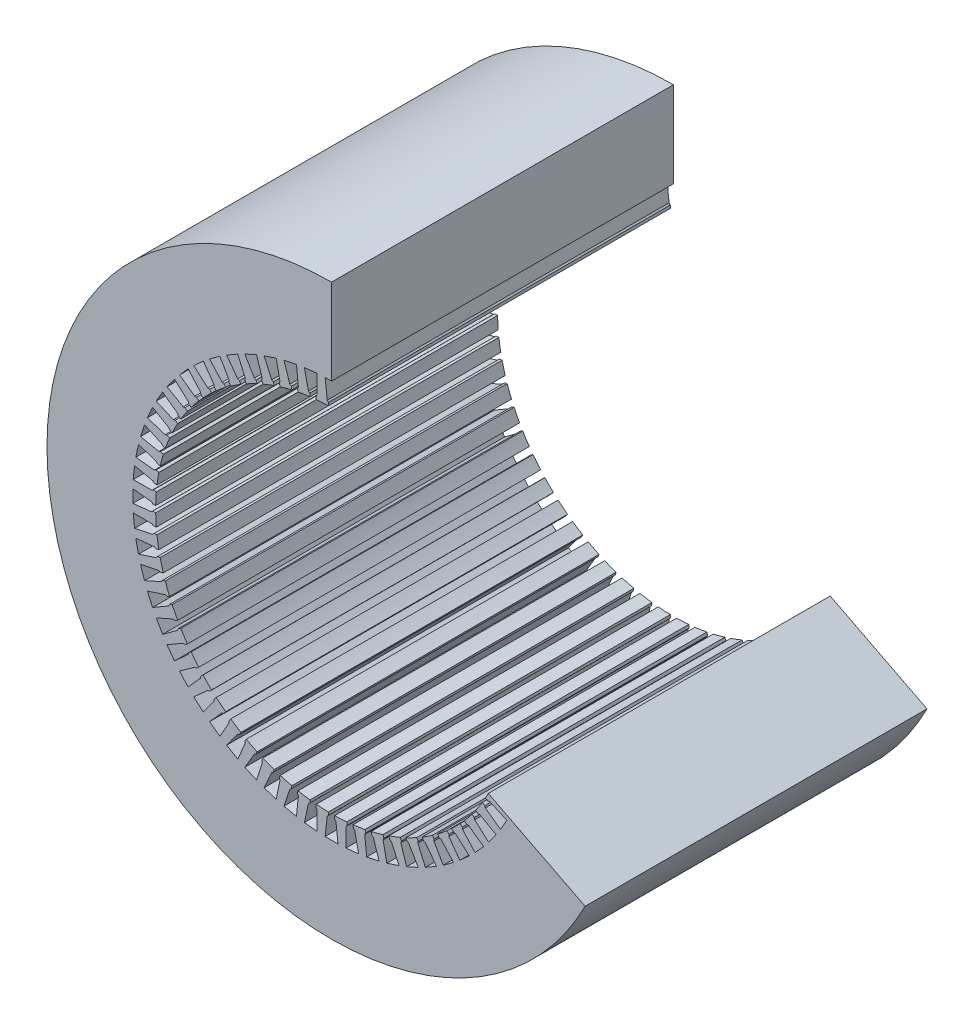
from build123d import *

# Parameters (mm, degrees)
SKICA1_R                 = 127
P_IDAT_VYSUNUT_M1_DEPTH  = 152.6
M_TKO1_SCALE             = 0.655
ODEBRAT_VYSUNUT_M1_DEPTH = 155.369979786


with BuildPart() as part:
    # Skica1 → P_idat vysunut_m1 (new body)
    with BuildSketch(Plane.XY):
        Circle(SKICA1_R)
        with BuildLine():
            Line((1.945, 80.4), (1.4, 79.8))
            Line((1.4, 79.8), (1.4, 78.487514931))
            ThreePointArc((1.4, 78.487514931), (4.108372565, 78.392418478), (6.811848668, 78.20389196))
            Line((6.811848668, 78.20389196), (6.949040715, 79.509187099))
            Line((6.949040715, 79.509187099), (6.46974336, 80.162868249))
            Line((6.46974336, 80.162868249), (6.433359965, 88.522466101))
            Line((6.433359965, 88.522466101), (12.112079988, 87.925608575))
            Line((12.112079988, 87.925608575), (10.338433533, 79.756252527))
            Line((10.338433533, 79.756252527), (9.733702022, 79.216507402))
            Line((9.733702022, 79.216507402), (9.596509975, 77.911212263))
            ThreePointArc((9.596509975, 77.911212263), (12.280105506, 77.533534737), (14.949065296, 77.063450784))
            Line((14.949065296, 77.063450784), (15.221946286, 78.347254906))
            Line((15.221946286, 78.347254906), (14.813602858, 79.047455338))
            Line((14.813602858, 79.047455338), (15.651234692, 87.365061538))
            Line((15.651234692, 87.365061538), (21.236457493, 86.177885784))
            Line((21.236457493, 86.177885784), (18.618597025, 78.23867886))
            Line((18.618597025, 78.23867886), (17.960759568, 77.765102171))
            Line((17.960759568, 77.765102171), (17.687878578, 76.48129805))
            ThreePointArc((17.687878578, 76.48129805), (20.317295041, 75.825177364), (22.922496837, 75.078686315))
            Line((22.922496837, 75.078686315), (23.328077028, 76.326933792))
            Line((23.328077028, 76.326933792), (22.995161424, 77.065981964))
            Line((22.995161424, 77.065981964), (24.697631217, 85.250467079))
            Line((24.697631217, 85.250467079), (30.128163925, 83.485980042))
            Line((30.128163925, 83.485980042), (26.694771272, 75.863905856))
            Line((26.694771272, 75.863905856), (25.991035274, 75.461686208))
            Line((25.991035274, 75.461686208), (25.585455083, 74.213438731))
            ThreePointArc((25.585455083, 74.213438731), (28.131884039, 73.28606348), (30.644784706, 72.271344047))
            Line((30.644784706, 72.271344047), (31.178620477, 73.47035882))
            Line((31.178620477, 73.47035882), (30.924780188, 74.240157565))
            Line((30.924780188, 74.240157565), (33.473435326, 82.201850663))
            Line((33.473435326, 82.201850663), (38.689779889, 79.879384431))
            Line((38.689779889, 79.879384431), (34.478472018, 72.657952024))
            Line((34.478472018, 72.657952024), (33.736547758, 72.33149622))
            Line((33.736547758, 72.33149622), (33.202711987, 71.132481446))
            ThreePointArc((33.202711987, 71.132481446), (35.63825423, 69.944012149), (38.0313219, 68.67218181))
            Line((38.0313219, 68.67218181), (38.687564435, 69.808827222))
            Line((38.687564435, 69.808827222), (38.51558059, 70.600942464))
            Line((38.51558059, 70.600942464), (41.882497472, 78.25261357))
            Line((41.882497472, 78.25261357), (46.827502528, 75.39761357))
            Line((46.827502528, 75.39761357), (41.88441941, 68.655942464))
            Line((41.88441941, 68.655942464), (41.112435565, 68.408827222))
            Line((41.112435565, 68.408827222), (40.456193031, 67.27218181))
            ThreePointArc((40.456193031, 67.27218181), (42.754164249, 65.835639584), (45.001179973, 64.320632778))
            Line((45.001179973, 64.320632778), (45.772639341, 65.382455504))
            Line((45.772639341, 65.382455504), (45.68439623, 66.188208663))
            Line((45.68439623, 66.188208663), (49.832686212, 73.446024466))
            Line((49.832686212, 73.446024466), (54.45217325, 70.089770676))
            Line((54.45217325, 70.089770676), (48.831472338, 63.901724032))
            Line((48.831472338, 63.901724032), (48.037886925, 63.736656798))
            Line((48.037886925, 63.736656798), (47.266427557, 62.674834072))
            ThreePointArc((47.266427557, 62.674834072), (49.401650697, 61.005957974), (51.477995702, 59.264373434))
            Line((51.477995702, 59.264373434), (52.356219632, 60.239739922))
            Line((52.356219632, 60.239739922), (52.352684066, 61.050302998))
            Line((52.352684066, 61.050302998), (57.236897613, 67.834745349))
            Line((57.236897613, 67.834745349), (61.480254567, 64.014009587))
            Line((61.480254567, 64.014009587), (55.243517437, 58.447384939))
            Line((55.243517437, 58.447384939), (54.437025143, 58.366174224))
            Line((54.437025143, 58.366174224), (53.558801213, 57.390807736))
            ThreePointArc((53.558801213, 57.390807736), (55.507882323, 55.507882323), (57.390807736, 53.558801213))
            Line((57.390807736, 53.558801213), (58.366174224, 54.437025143))
            Line((58.366174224, 54.437025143), (58.447384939, 55.243517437))
            Line((58.447384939, 55.243517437), (64.014009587, 61.480254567))
            Line((64.014009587, 61.480254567), (67.834745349, 57.236897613))
            Line((67.834745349, 57.236897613), (61.050302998, 52.352684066))
            Line((61.050302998, 52.352684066), (60.239739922, 52.356219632))
            Line((60.239739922, 52.356219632), (59.264373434, 51.477995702))
            ThreePointArc((59.264373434, 51.477995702), (61.005957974, 49.401650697), (62.674834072, 47.266427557))
            Line((62.674834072, 47.266427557), (63.736656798, 48.037886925))
            Line((63.736656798, 48.037886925), (63.901724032, 48.831472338))
            Line((63.901724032, 48.831472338), (70.089770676, 54.45217325))
            Line((70.089770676, 54.45217325), (73.446024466, 49.832686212))
            Line((73.446024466, 49.832686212), (66.188208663, 45.68439623))
            Line((66.188208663, 45.68439623), (65.382455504, 45.772639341))
            Line((65.382455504, 45.772639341), (64.320632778, 45.001179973))
            ThreePointArc((64.320632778, 45.001179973), (65.835639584, 42.754164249), (67.27218181, 40.456193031))
            Line((67.27218181, 40.456193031), (68.408827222, 41.112435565))
            Line((68.408827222, 41.112435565), (68.655942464, 41.88441941))
            Line((68.655942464, 41.88441941), (75.39761357, 46.827502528))
            Line((75.39761357, 46.827502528), (78.25261357, 41.882497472))
            Line((78.25261357, 41.882497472), (70.600942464, 38.51558059))
            Line((70.600942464, 38.51558059), (69.808827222, 38.687564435))
            Line((69.808827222, 38.687564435), (68.67218181, 38.0313219))
            ThreePointArc((68.67218181, 38.0313219), (69.944012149, 35.63825423), (71.132481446, 33.202711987))
            Line((71.132481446, 33.202711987), (72.33149622, 33.736547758))
            Line((72.33149622, 33.736547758), (72.657952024, 34.478472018))
            Line((72.657952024, 34.478472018), (79.879384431, 38.689779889))
            Line((79.879384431, 38.689779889), (82.201850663, 33.473435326))
            Line((82.201850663, 33.473435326), (74.240157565, 30.924780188))
            Line((74.240157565, 30.924780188), (73.47035882, 31.178620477))
            Line((73.47035882, 31.178620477), (72.271344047, 30.644784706))
            ThreePointArc((72.271344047, 30.644784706), (73.28606348, 28.131884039), (74.213438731, 25.585455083))
            Line((74.213438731, 25.585455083), (75.461686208, 25.991035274))
            Line((75.461686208, 25.991035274), (75.863905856, 26.694771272))
            Line((75.863905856, 26.694771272), (83.485980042, 30.128163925))
            Line((83.485980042, 30.128163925), (85.250467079, 24.697631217))
            Line((85.250467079, 24.697631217), (77.065981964, 22.995161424))
            Line((77.065981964, 22.995161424), (76.326933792, 23.328077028))
            Line((76.326933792, 23.328077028), (75.078686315, 22.922496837))
            ThreePointArc((75.078686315, 22.922496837), (75.825177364, 20.317295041), (76.48129805, 17.687878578))
            Line((76.48129805, 17.687878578), (77.765102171, 17.960759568))
            Line((77.765102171, 17.960759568), (78.23867886, 18.618597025))
            Line((78.23867886, 18.618597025), (86.177885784, 21.236457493))
            Line((86.177885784, 21.236457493), (87.365061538, 15.651234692))
            Line((87.365061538, 15.651234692), (79.047455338, 14.813602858))
            Line((79.047455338, 14.813602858), (78.347254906, 15.221946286))
            Line((78.347254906, 15.221946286), (77.063450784, 14.949065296))
            ThreePointArc((77.063450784, 14.949065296), (77.533534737, 12.280105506), (77.911212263, 9.596509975))
            Line((77.911212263, 9.596509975), (79.216507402, 9.733702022))
            Line((79.216507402, 9.733702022), (79.756252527, 10.338433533))
            Line((79.756252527, 10.338433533), (87.925608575, 12.112079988))
            Line((87.925608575, 12.112079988), (88.522466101, 6.433359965))
            Line((88.522466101, 6.433359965), (80.162868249, 6.46974336))
            Line((80.162868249, 6.46974336), (79.509187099, 6.949040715))
            Line((79.509187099, 6.949040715), (78.20389196, 6.811848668))
            ThreePointArc((78.20389196, 6.811848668), (78.392418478, 4.108372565), (78.487514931, 1.4))
            Line((78.487514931, 1.4), (79.8, 1.4))
            Line((79.8, 1.4), (80.4, 1.945))
            Line((80.4, 1.945), (88.71, 2.855))
            Line((88.71, 2.855), (88.71, -2.855))
            Line((88.71, -2.855), (80.4, -1.945))
            Line((80.4, -1.945), (79.8, -1.4))
            Line((79.8, -1.4), (78.487514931, -1.4))
            ThreePointArc((78.487514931, -1.4), (78.392418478, -4.108372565), (78.20389196, -6.811848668))
            Line((78.20389196, -6.811848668), (79.509187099, -6.949040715))
            Line((79.509187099, -6.949040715), (80.162868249, -6.46974336))
            Line((80.162868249, -6.46974336), (88.522466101, -6.433359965))
            Line((88.522466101, -6.433359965), (87.925608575, -12.112079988))
            Line((87.925608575, -12.112079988), (79.756252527, -10.338433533))
            Line((79.756252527, -10.338433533), (79.216507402, -9.733702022))
            Line((79.216507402, -9.733702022), (77.911212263, -9.596509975))
            ThreePointArc((77.911212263, -9.596509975), (77.533534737, -12.280105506), (77.063450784, -14.949065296))
            Line((77.063450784, -14.949065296), (78.347254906, -15.221946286))
            Line((78.347254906, -15.221946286), (79.047455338, -14.813602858))
            Line((79.047455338, -14.813602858), (87.365061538, -15.651234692))
            Line((87.365061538, -15.651234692), (86.177885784, -21.236457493))
            Line((86.177885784, -21.236457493), (78.23867886, -18.618597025))
            Line((78.23867886, -18.618597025), (77.765102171, -17.960759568))
            Line((77.765102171, -17.960759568), (76.48129805, -17.687878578))
            ThreePointArc((76.48129805, -17.687878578), (75.825177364, -20.317295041), (75.078686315, -22.922496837))
            Line((75.078686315, -22.922496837), (76.326933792, -23.328077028))
            Line((76.326933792, -23.328077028), (77.065981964, -22.995161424))
            Line((77.065981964, -22.995161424), (85.250467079, -24.697631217))
            Line((85.250467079, -24.697631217), (83.485980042, -30.128163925))
            Line((83.485980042, -30.128163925), (75.863905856, -26.694771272))
            Line((75.863905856, -26.694771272), (75.461686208, -25.991035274))
            Line((75.461686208, -25.991035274), (74.213438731, -25.585455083))
            ThreePointArc((74.213438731, -25.585455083), (73.28606348, -28.131884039), (72.271344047, -30.644784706))
            Line((72.271344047, -30.644784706), (73.47035882, -31.178620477))
            Line((73.47035882, -31.178620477), (74.240157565, -30.924780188))
            Line((74.240157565, -30.924780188), (82.201850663, -33.473435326))
            Line((82.201850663, -33.473435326), (79.879384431, -38.689779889))
            Line((79.879384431, -38.689779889), (72.657952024, -34.478472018))
            Line((72.657952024, -34.478472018), (72.33149622, -33.736547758))
            Line((72.33149622, -33.736547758), (71.132481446, -33.202711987))
            ThreePointArc((71.132481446, -33.202711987), (69.944012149, -35.63825423), (68.67218181, -38.0313219))
            Line((68.67218181, -38.0313219), (69.808827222, -38.687564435))
            Line((69.808827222, -38.687564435), (70.600942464, -38.51558059))
            Line((70.600942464, -38.51558059), (78.25261357, -41.882497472))
            Line((78.25261357, -41.882497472), (75.39761357, -46.827502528))
            Line((75.39761357, -46.827502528), (68.655942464, -41.88441941))
            Line((68.655942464, -41.88441941), (68.408827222, -41.112435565))
            Line((68.408827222, -41.112435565), (67.27218181, -40.456193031))
            ThreePointArc((67.27218181, -40.456193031), (65.835639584, -42.754164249), (64.320632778, -45.001179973))
            Line((64.320632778, -45.001179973), (65.382455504, -45.772639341))
            Line((65.382455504, -45.772639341), (66.188208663, -45.68439623))
            Line((66.188208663, -45.68439623), (73.446024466, -49.832686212))
            Line((73.446024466, -49.832686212), (70.089770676, -54.45217325))
            Line((70.089770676, -54.45217325), (63.901724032, -48.831472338))
            Line((63.901724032, -48.831472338), (63.736656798, -48.037886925))
            Line((63.736656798, -48.037886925), (62.674834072, -47.266427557))
            ThreePointArc((62.674834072, -47.266427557), (61.005957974, -49.401650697), (59.264373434, -51.477995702))
            Line((59.264373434, -51.477995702), (60.239739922, -52.356219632))
            Line((60.239739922, -52.356219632), (61.050302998, -52.352684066))
            Line((61.050302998, -52.352684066), (67.834745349, -57.236897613))
            Line((67.834745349, -57.236897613), (64.014009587, -61.480254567))
            Line((64.014009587, -61.480254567), (58.447384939, -55.243517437))
            Line((58.447384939, -55.243517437), (58.366174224, -54.437025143))
            Line((58.366174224, -54.437025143), (57.390807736, -53.558801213))
            ThreePointArc((57.390807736, -53.558801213), (55.507882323, -55.507882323), (53.558801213, -57.390807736))
            Line((53.558801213, -57.390807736), (54.437025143, -58.366174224))
            Line((54.437025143, -58.366174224), (55.243517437, -58.447384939))
            Line((55.243517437, -58.447384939), (61.480254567, -64.014009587))
            Line((61.480254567, -64.014009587), (57.236897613, -67.834745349))
            Line((57.236897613, -67.834745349), (52.352684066, -61.050302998))
            Line((52.352684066, -61.050302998), (52.356219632, -60.239739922))
            Line((52.356219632, -60.239739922), (51.477995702, -59.264373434))
            ThreePointArc((51.477995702, -59.264373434), (49.401650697, -61.005957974), (47.266427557, -62.674834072))
            Line((47.266427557, -62.674834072), (48.037886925, -63.736656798))
            Line((48.037886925, -63.736656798), (48.831472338, -63.901724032))
            Line((48.831472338, -63.901724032), (54.45217325, -70.089770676))
            Line((54.45217325, -70.089770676), (49.832686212, -73.446024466))
            Line((49.832686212, -73.446024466), (45.68439623, -66.188208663))
            Line((45.68439623, -66.188208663), (45.772639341, -65.382455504))
            Line((45.772639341, -65.382455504), (45.001179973, -64.320632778))
            ThreePointArc((45.001179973, -64.320632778), (42.754164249, -65.835639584), (40.456193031, -67.27218181))
            Line((40.456193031, -67.27218181), (41.112435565, -68.408827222))
            Line((41.112435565, -68.408827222), (41.88441941, -68.655942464))
            Line((41.88441941, -68.655942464), (46.827502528, -75.39761357))
            Line((46.827502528, -75.39761357), (41.882497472, -78.25261357))
            Line((41.882497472, -78.25261357), (38.51558059, -70.600942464))
            Line((38.51558059, -70.600942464), (38.687564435, -69.808827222))
            Line((38.687564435, -69.808827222), (38.0313219, -68.67218181))
            ThreePointArc((38.0313219, -68.67218181), (35.63825423, -69.944012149), (33.202711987, -71.132481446))
            Line((33.202711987, -71.132481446), (33.736547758, -72.33149622))
            Line((33.736547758, -72.33149622), (34.478472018, -72.657952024))
            Line((34.478472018, -72.657952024), (38.689779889, -79.879384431))
            Line((38.689779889, -79.879384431), (33.473435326, -82.201850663))
            Line((33.473435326, -82.201850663), (30.924780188, -74.240157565))
            Line((30.924780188, -74.240157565), (31.178620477, -73.47035882))
            Line((31.178620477, -73.47035882), (30.644784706, -72.271344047))
            ThreePointArc((30.644784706, -72.271344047), (28.131884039, -73.28606348), (25.585455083, -74.213438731))
            Line((25.585455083, -74.213438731), (25.991035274, -75.461686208))
            Line((25.991035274, -75.461686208), (26.694771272, -75.863905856))
            Line((26.694771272, -75.863905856), (30.128163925, -83.485980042))
            Line((30.128163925, -83.485980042), (24.697631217, -85.250467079))
            Line((24.697631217, -85.250467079), (22.995161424, -77.065981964))
            Line((22.995161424, -77.065981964), (23.328077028, -76.326933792))
            Line((23.328077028, -76.326933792), (22.922496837, -75.078686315))
            ThreePointArc((22.922496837, -75.078686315), (20.317295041, -75.825177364), (17.687878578, -76.48129805))
            Line((17.687878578, -76.48129805), (17.960759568, -77.765102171))
            Line((17.960759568, -77.765102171), (18.618597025, -78.23867886))
            Line((18.618597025, -78.23867886), (21.236457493, -86.177885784))
            Line((21.236457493, -86.177885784), (15.651234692, -87.365061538))
            Line((15.651234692, -87.365061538), (14.813602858, -79.047455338))
            Line((14.813602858, -79.047455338), (15.221946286, -78.347254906))
            Line((15.221946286, -78.347254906), (14.949065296, -77.063450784))
            ThreePointArc((14.949065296, -77.063450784), (12.280105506, -77.533534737), (9.596509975, -77.911212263))
            Line((9.596509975, -77.911212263), (9.733702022, -79.216507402))
            Line((9.733702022, -79.216507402), (10.338433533, -79.756252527))
            Line((10.338433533, -79.756252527), (12.112079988, -87.925608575))
            Line((12.112079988, -87.925608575), (6.433359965, -88.522466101))
            Line((6.433359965, -88.522466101), (6.46974336, -80.162868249))
            Line((6.46974336, -80.162868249), (6.949040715, -79.509187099))
            Line((6.949040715, -79.509187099), (6.811848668, -78.20389196))
            ThreePointArc((6.811848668, -78.20389196), (4.108372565, -78.392418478), (1.4, -78.487514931))
            Line((1.4, -78.487514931), (1.4, -79.8))
            Line((1.4, -79.8), (1.945, -80.4))
            Line((1.945, -80.4), (2.855, -88.71))
            Line((2.855, -88.71), (-2.855, -88.71))
            Line((-2.855, -88.71), (-1.945, -80.4))
            Line((-1.945, -80.4), (-1.4, -79.8))
            Line((-1.4, -79.8), (-1.4, -78.487514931))
            ThreePointArc((-1.4, -78.487514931), (-4.108372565, -78.392418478), (-6.811848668, -78.20389196))
            Line((-6.811848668, -78.20389196), (-6.949040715, -79.509187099))
            Line((-6.949040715, -79.509187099), (-6.46974336, -80.162868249))
            Line((-6.46974336, -80.162868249), (-6.433359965, -88.522466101))
            Line((-6.433359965, -88.522466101), (-12.112079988, -87.925608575))
            Line((-12.112079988, -87.925608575), (-10.338433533, -79.756252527))
            Line((-10.338433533, -79.756252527), (-9.733702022, -79.216507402))
            Line((-9.733702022, -79.216507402), (-9.596509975, -77.911212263))
            ThreePointArc((-9.596509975, -77.911212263), (-12.280105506, -77.533534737), (-14.949065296, -77.063450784))
            Line((-14.949065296, -77.063450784), (-15.221946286, -78.347254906))
            Line((-15.221946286, -78.347254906), (-14.813602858, -79.047455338))
            Line((-14.813602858, -79.047455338), (-15.651234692, -87.365061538))
            Line((-15.651234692, -87.365061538), (-21.236457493, -86.177885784))
            Line((-21.236457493, -86.177885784), (-18.618597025, -78.23867886))
            Line((-18.618597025, -78.23867886), (-17.960759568, -77.765102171))
            Line((-17.960759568, -77.765102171), (-17.687878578, -76.48129805))
            ThreePointArc((-17.687878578, -76.48129805), (-20.317295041, -75.825177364), (-22.922496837, -75.078686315))
            Line((-22.922496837, -75.078686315), (-23.328077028, -76.326933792))
            Line((-23.328077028, -76.326933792), (-22.995161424, -77.065981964))
            Line((-22.995161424, -77.065981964), (-24.697631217, -85.250467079))
            Line((-24.697631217, -85.250467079), (-30.128163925, -83.485980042))
            Line((-30.128163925, -83.485980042), (-26.694771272, -75.863905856))
            Line((-26.694771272, -75.863905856), (-25.991035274, -75.461686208))
            Line((-25.991035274, -75.461686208), (-25.585455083, -74.213438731))
            ThreePointArc((-25.585455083, -74.213438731), (-28.131884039, -73.28606348), (-30.644784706, -72.271344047))
            Line((-30.644784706, -72.271344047), (-31.178620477, -73.47035882))
            Line((-31.178620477, -73.47035882), (-30.924780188, -74.240157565))
            Line((-30.924780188, -74.240157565), (-33.473435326, -82.201850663))
            Line((-33.473435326, -82.201850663), (-38.689779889, -79.879384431))
            Line((-38.689779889, -79.879384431), (-34.478472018, -72.657952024))
            Line((-34.478472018, -72.657952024), (-33.736547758, -72.33149622))
            Line((-33.736547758, -72.33149622), (-33.202711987, -71.132481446))
            ThreePointArc((-33.202711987, -71.132481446), (-35.63825423, -69.944012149), (-38.0313219, -68.67218181))
            Line((-38.0313219, -68.67218181), (-38.687564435, -69.808827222))
            Line((-38.687564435, -69.808827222), (-38.51558059, -70.600942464))
            Line((-38.51558059, -70.600942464), (-41.882497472, -78.25261357))
            Line((-41.882497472, -78.25261357), (-46.827502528, -75.39761357))
            Line((-46.827502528, -75.39761357), (-41.88441941, -68.655942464))
            Line((-41.88441941, -68.655942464), (-41.112435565, -68.408827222))
            Line((-41.112435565, -68.408827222), (-40.456193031, -67.27218181))
            ThreePointArc((-40.456193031, -67.27218181), (-42.754164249, -65.835639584), (-45.001179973, -64.320632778))
            Line((-45.001179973, -64.320632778), (-45.772639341, -65.382455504))
            Line((-45.772639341, -65.382455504), (-45.68439623, -66.188208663))
            Line((-45.68439623, -66.188208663), (-49.832686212, -73.446024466))
            Line((-49.832686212, -73.446024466), (-54.45217325, -70.089770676))
            Line((-54.45217325, -70.089770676), (-48.831472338, -63.901724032))
            Line((-48.831472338, -63.901724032), (-48.037886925, -63.736656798))
            Line((-48.037886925, -63.736656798), (-47.266427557, -62.674834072))
            ThreePointArc((-47.266427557, -62.674834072), (-49.401650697, -61.005957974), (-51.477995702, -59.264373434))
            Line((-51.477995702, -59.264373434), (-52.356219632, -60.239739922))
            Line((-52.356219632, -60.239739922), (-52.352684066, -61.050302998))
            Line((-52.352684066, -61.050302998), (-57.236897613, -67.834745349))
            Line((-57.236897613, -67.834745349), (-61.480254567, -64.014009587))
            Line((-61.480254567, -64.014009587), (-55.243517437, -58.447384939))
            Line((-55.243517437, -58.447384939), (-54.437025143, -58.366174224))
            Line((-54.437025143, -58.366174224), (-53.558801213, -57.390807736))
            ThreePointArc((-53.558801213, -57.390807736), (-55.507882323, -55.507882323), (-57.390807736, -53.558801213))
            Line((-57.390807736, -53.558801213), (-58.366174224, -54.437025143))
            Line((-58.366174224, -54.437025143), (-58.447384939, -55.243517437))
            Line((-58.447384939, -55.243517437), (-64.014009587, -61.480254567))
            Line((-64.014009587, -61.480254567), (-67.834745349, -57.236897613))
            Line((-67.834745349, -57.236897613), (-61.050302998, -52.352684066))
            Line((-61.050302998, -52.352684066), (-60.239739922, -52.356219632))
            Line((-60.239739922, -52.356219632), (-59.264373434, -51.477995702))
            ThreePointArc((-59.264373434, -51.477995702), (-61.005957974, -49.401650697), (-62.674834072, -47.266427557))
            Line((-62.674834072, -47.266427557), (-63.736656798, -48.037886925))
            Line((-63.736656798, -48.037886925), (-63.901724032, -48.831472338))
            Line((-63.901724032, -48.831472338), (-70.089770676, -54.45217325))
            Line((-70.089770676, -54.45217325), (-73.446024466, -49.832686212))
            Line((-73.446024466, -49.832686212), (-66.188208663, -45.68439623))
            Line((-66.188208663, -45.68439623), (-65.382455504, -45.772639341))
            Line((-65.382455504, -45.772639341), (-64.320632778, -45.001179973))
            ThreePointArc((-64.320632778, -45.001179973), (-65.835639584, -42.754164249), (-67.27218181, -40.456193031))
            Line((-67.27218181, -40.456193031), (-68.408827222, -41.112435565))
            Line((-68.408827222, -41.112435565), (-68.655942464, -41.88441941))
            Line((-68.655942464, -41.88441941), (-75.39761357, -46.827502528))
            Line((-75.39761357, -46.827502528), (-78.25261357, -41.882497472))
            Line((-78.25261357, -41.882497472), (-70.600942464, -38.51558059))
            Line((-70.600942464, -38.51558059), (-69.808827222, -38.687564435))
            Line((-69.808827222, -38.687564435), (-68.67218181, -38.0313219))
            ThreePointArc((-68.67218181, -38.0313219), (-69.944012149, -35.63825423), (-71.132481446, -33.202711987))
            Line((-71.132481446, -33.202711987), (-72.33149622, -33.736547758))
            Line((-72.33149622, -33.736547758), (-72.657952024, -34.478472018))
            Line((-72.657952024, -34.478472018), (-79.879384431, -38.689779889))
            Line((-79.879384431, -38.689779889), (-82.201850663, -33.473435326))
            Line((-82.201850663, -33.473435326), (-74.240157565, -30.924780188))
            Line((-74.240157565, -30.924780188), (-73.47035882, -31.178620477))
            Line((-73.47035882, -31.178620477), (-72.271344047, -30.644784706))
            ThreePointArc((-72.271344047, -30.644784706), (-73.28606348, -28.131884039), (-74.213438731, -25.585455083))
            Line((-74.213438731, -25.585455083), (-75.461686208, -25.991035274))
            Line((-75.461686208, -25.991035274), (-75.863905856, -26.694771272))
            Line((-75.863905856, -26.694771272), (-83.485980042, -30.128163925))
            Line((-83.485980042, -30.128163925), (-85.250467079, -24.697631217))
            Line((-85.250467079, -24.697631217), (-77.065981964, -22.995161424))
            Line((-77.065981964, -22.995161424), (-76.326933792, -23.328077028))
            Line((-76.326933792, -23.328077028), (-75.078686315, -22.922496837))
            ThreePointArc((-75.078686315, -22.922496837), (-75.825177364, -20.317295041), (-76.48129805, -17.687878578))
            Line((-76.48129805, -17.687878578), (-77.765102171, -17.960759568))
            Line((-77.765102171, -17.960759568), (-78.23867886, -18.618597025))
            Line((-78.23867886, -18.618597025), (-86.177885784, -21.236457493))
            Line((-86.177885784, -21.236457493), (-87.365061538, -15.651234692))
            Line((-87.365061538, -15.651234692), (-79.047455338, -14.813602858))
            Line((-79.047455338, -14.813602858), (-78.347254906, -15.221946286))
            Line((-78.347254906, -15.221946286), (-77.063450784, -14.949065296))
            ThreePointArc((-77.063450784, -14.949065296), (-77.533534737, -12.280105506), (-77.911212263, -9.596509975))
            Line((-77.911212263, -9.596509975), (-79.216507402, -9.733702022))
            Line((-79.216507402, -9.733702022), (-79.756252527, -10.338433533))
            Line((-79.756252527, -10.338433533), (-87.925608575, -12.112079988))
            Line((-87.925608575, -12.112079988), (-88.522466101, -6.433359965))
            Line((-88.522466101, -6.433359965), (-80.162868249, -6.46974336))
            Line((-80.162868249, -6.46974336), (-79.509187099, -6.949040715))
            Line((-79.509187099, -6.949040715), (-78.20389196, -6.811848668))
            ThreePointArc((-78.20389196, -6.811848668), (-78.392418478, -4.108372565), (-78.487514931, -1.4))
            Line((-78.487514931, -1.4), (-79.8, -1.4))
            Line((-79.8, -1.4), (-80.4, -1.945))
            Line((-80.4, -1.945), (-88.71, -2.855))
            Line((-88.71, -2.855), (-88.71, 2.855))
            Line((-88.71, 2.855), (-80.4, 1.945))
            Line((-80.4, 1.945), (-79.8, 1.4))
            Line((-79.8, 1.4), (-78.487514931, 1.4))
            ThreePointArc((-78.487514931, 1.4), (-78.392418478, 4.108372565), (-78.20389196, 6.811848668))
            Line((-78.20389196, 6.811848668), (-79.509187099, 6.949040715))
            Line((-79.509187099, 6.949040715), (-80.162868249, 6.46974336))
            Line((-80.162868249, 6.46974336), (-88.522466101, 6.433359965))
            Line((-88.522466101, 6.433359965), (-87.925608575, 12.112079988))
            Line((-87.925608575, 12.112079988), (-79.756252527, 10.338433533))
            Line((-79.756252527, 10.338433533), (-79.216507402, 9.733702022))
            Line((-79.216507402, 9.733702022), (-77.911212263, 9.596509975))
            ThreePointArc((-77.911212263, 9.596509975), (-77.533534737, 12.280105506), (-77.063450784, 14.949065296))
            Line((-77.063450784, 14.949065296), (-78.347254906, 15.221946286))
            Line((-78.347254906, 15.221946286), (-79.047455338, 14.813602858))
            Line((-79.047455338, 14.813602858), (-87.365061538, 15.651234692))
            Line((-87.365061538, 15.651234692), (-86.177885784, 21.236457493))
            Line((-86.177885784, 21.236457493), (-78.23867886, 18.618597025))
            Line((-78.23867886, 18.618597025), (-77.765102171, 17.960759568))
            Line((-77.765102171, 17.960759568), (-76.48129805, 17.687878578))
            ThreePointArc((-76.48129805, 17.687878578), (-75.825177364, 20.317295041), (-75.078686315, 22.922496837))
            Line((-75.078686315, 22.922496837), (-76.326933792, 23.328077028))
            Line((-76.326933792, 23.328077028), (-77.065981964, 22.995161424))
            Line((-77.065981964, 22.995161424), (-85.250467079, 24.697631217))
            Line((-85.250467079, 24.697631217), (-83.485980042, 30.128163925))
            Line((-83.485980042, 30.128163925), (-75.863905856, 26.694771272))
            Line((-75.863905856, 26.694771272), (-75.461686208, 25.991035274))
            Line((-75.461686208, 25.991035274), (-74.213438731, 25.585455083))
            ThreePointArc((-74.213438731, 25.585455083), (-73.28606348, 28.131884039), (-72.271344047, 30.644784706))
            Line((-72.271344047, 30.644784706), (-73.47035882, 31.178620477))
            Line((-73.47035882, 31.178620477), (-74.240157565, 30.924780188))
            Line((-74.240157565, 30.924780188), (-82.201850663, 33.473435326))
            Line((-82.201850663, 33.473435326), (-79.879384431, 38.689779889))
            Line((-79.879384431, 38.689779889), (-72.657952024, 34.478472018))
            Line((-72.657952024, 34.478472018), (-72.33149622, 33.736547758))
            Line((-72.33149622, 33.736547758), (-71.132481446, 33.202711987))
            ThreePointArc((-71.132481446, 33.202711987), (-69.944012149, 35.63825423), (-68.67218181, 38.0313219))
            Line((-68.67218181, 38.0313219), (-69.808827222, 38.687564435))
            Line((-69.808827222, 38.687564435), (-70.600942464, 38.51558059))
            Line((-70.600942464, 38.51558059), (-78.25261357, 41.882497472))
            Line((-78.25261357, 41.882497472), (-75.39761357, 46.827502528))
            Line((-75.39761357, 46.827502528), (-68.655942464, 41.88441941))
            Line((-68.655942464, 41.88441941), (-68.408827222, 41.112435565))
            Line((-68.408827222, 41.112435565), (-67.27218181, 40.456193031))
            ThreePointArc((-67.27218181, 40.456193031), (-65.835639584, 42.754164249), (-64.320632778, 45.001179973))
            Line((-64.320632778, 45.001179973), (-65.382455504, 45.772639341))
            Line((-65.382455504, 45.772639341), (-66.188208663, 45.68439623))
            Line((-66.188208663, 45.68439623), (-73.446024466, 49.832686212))
            Line((-73.446024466, 49.832686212), (-70.089770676, 54.45217325))
            Line((-70.089770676, 54.45217325), (-63.901724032, 48.831472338))
            Line((-63.901724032, 48.831472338), (-63.736656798, 48.037886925))
            Line((-63.736656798, 48.037886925), (-62.674834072, 47.266427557))
            ThreePointArc((-62.674834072, 47.266427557), (-61.005957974, 49.401650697), (-59.264373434, 51.477995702))
            Line((-59.264373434, 51.477995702), (-60.239739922, 52.356219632))
            Line((-60.239739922, 52.356219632), (-61.050302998, 52.352684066))
            Line((-61.050302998, 52.352684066), (-67.834745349, 57.236897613))
            Line((-67.834745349, 57.236897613), (-64.014009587, 61.480254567))
            Line((-64.014009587, 61.480254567), (-58.447384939, 55.243517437))
            Line((-58.447384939, 55.243517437), (-58.366174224, 54.437025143))
            Line((-58.366174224, 54.437025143), (-57.390807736, 53.558801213))
            ThreePointArc((-57.390807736, 53.558801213), (-55.507882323, 55.507882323), (-53.558801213, 57.390807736))
            Line((-53.558801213, 57.390807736), (-54.437025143, 58.366174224))
            Line((-54.437025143, 58.366174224), (-55.243517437, 58.447384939))
            Line((-55.243517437, 58.447384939), (-61.480254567, 64.014009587))
            Line((-61.480254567, 64.014009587), (-57.236897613, 67.834745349))
            Line((-57.236897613, 67.834745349), (-52.352684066, 61.050302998))
            Line((-52.352684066, 61.050302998), (-52.356219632, 60.239739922))
            Line((-52.356219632, 60.239739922), (-51.477995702, 59.264373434))
            ThreePointArc((-51.477995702, 59.264373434), (-49.401650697, 61.005957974), (-47.266427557, 62.674834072))
            Line((-47.266427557, 62.674834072), (-48.037886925, 63.736656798))
            Line((-48.037886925, 63.736656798), (-48.831472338, 63.901724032))
            Line((-48.831472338, 63.901724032), (-54.45217325, 70.089770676))
            Line((-54.45217325, 70.089770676), (-49.832686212, 73.446024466))
            Line((-49.832686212, 73.446024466), (-45.68439623, 66.188208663))
            Line((-45.68439623, 66.188208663), (-45.772639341, 65.382455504))
            Line((-45.772639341, 65.382455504), (-45.001179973, 64.320632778))
            ThreePointArc((-45.001179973, 64.320632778), (-42.754164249, 65.835639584), (-40.456193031, 67.27218181))
            Line((-40.456193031, 67.27218181), (-41.112435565, 68.408827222))
            Line((-41.112435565, 68.408827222), (-41.88441941, 68.655942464))
            Line((-41.88441941, 68.655942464), (-46.827502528, 75.39761357))
            Line((-46.827502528, 75.39761357), (-41.882497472, 78.25261357))
            Line((-41.882497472, 78.25261357), (-38.51558059, 70.600942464))
            Line((-38.51558059, 70.600942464), (-38.687564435, 69.808827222))
            Line((-38.687564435, 69.808827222), (-38.0313219, 68.67218181))
            ThreePointArc((-38.0313219, 68.67218181), (-35.63825423, 69.944012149), (-33.202711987, 71.132481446))
            Line((-33.202711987, 71.132481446), (-33.736547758, 72.33149622))
            Line((-33.736547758, 72.33149622), (-34.478472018, 72.657952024))
            Line((-34.478472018, 72.657952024), (-38.689779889, 79.879384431))
            Line((-38.689779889, 79.879384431), (-33.473435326, 82.201850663))
            Line((-33.473435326, 82.201850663), (-30.924780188, 74.240157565))
            Line((-30.924780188, 74.240157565), (-31.178620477, 73.47035882))
            Line((-31.178620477, 73.47035882), (-30.644784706, 72.271344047))
            ThreePointArc((-30.644784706, 72.271344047), (-28.131884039, 73.28606348), (-25.585455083, 74.213438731))
            Line((-25.585455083, 74.213438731), (-25.991035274, 75.461686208))
            Line((-25.991035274, 75.461686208), (-26.694771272, 75.863905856))
            Line((-26.694771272, 75.863905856), (-30.128163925, 83.485980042))
            Line((-30.128163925, 83.485980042), (-24.697631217, 85.250467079))
            Line((-24.697631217, 85.250467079), (-22.995161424, 77.065981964))
            Line((-22.995161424, 77.065981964), (-23.328077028, 76.326933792))
            Line((-23.328077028, 76.326933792), (-22.922496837, 75.078686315))
            ThreePointArc((-22.922496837, 75.078686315), (-20.317295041, 75.825177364), (-17.687878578, 76.48129805))
            Line((-17.687878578, 76.48129805), (-17.960759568, 77.765102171))
            Line((-17.960759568, 77.765102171), (-18.618597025, 78.23867886))
            Line((-18.618597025, 78.23867886), (-21.236457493, 86.177885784))
            Line((-21.236457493, 86.177885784), (-15.651234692, 87.365061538))
            Line((-15.651234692, 87.365061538), (-14.813602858, 79.047455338))
            Line((-14.813602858, 79.047455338), (-15.221946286, 78.347254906))
            Line((-15.221946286, 78.347254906), (-14.949065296, 77.063450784))
            ThreePointArc((-14.949065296, 77.063450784), (-12.280105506, 77.533534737), (-9.596509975, 77.911212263))
            Line((-9.596509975, 77.911212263), (-9.733702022, 79.216507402))
            Line((-9.733702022, 79.216507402), (-10.338433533, 79.756252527))
            Line((-10.338433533, 79.756252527), (-12.112079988, 87.925608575))
            Line((-12.112079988, 87.925608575), (-6.433359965, 88.522466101))
            Line((-6.433359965, 88.522466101), (-6.46974336, 80.162868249))
            Line((-6.46974336, 80.162868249), (-6.949040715, 79.509187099))
            Line((-6.949040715, 79.509187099), (-6.811848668, 78.20389196))
            ThreePointArc((-6.811848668, 78.20389196), (-4.108372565, 78.392418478), (-1.4, 78.487514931))
            Line((-1.4, 78.487514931), (-1.4, 79.8))
            Line((-1.4, 79.8), (-1.945, 80.4))
            Line((-1.945, 80.4), (-2.855, 88.71))
            Line((-2.855, 88.71), (0, 88.71))
            Line((0, 88.71), (2.855, 88.71))
            Line((2.855, 88.71), (1.945, 80.4))
        make_face(mode=Mode.SUBTRACT)
    extrude(amount=P_IDAT_VYSUNUT_M1_DEPTH)


with BuildPart() as part_1:
    # M_tko1: scaled about (0, 0, 0)
    add(part.part.scale(M_TKO1_SCALE))

    # Skica4 → Odebrat vysunut_m1 (cut, through all)
    with BuildSketch(Plane.XY.offset(99.953)):
        Polygon((0, 490.039146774), (0, 83.185), (0, 0), (74.118377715, -37.765199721), (436.628076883, -222.473117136), (1130.42845003, 202.68829834), (693.800373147, 915.20056225), align=None)
    extrude(amount=-ODEBRAT_VYSUNUT_M1_DEPTH, mode=Mode.SUBTRACT)


solid = part_1.part
